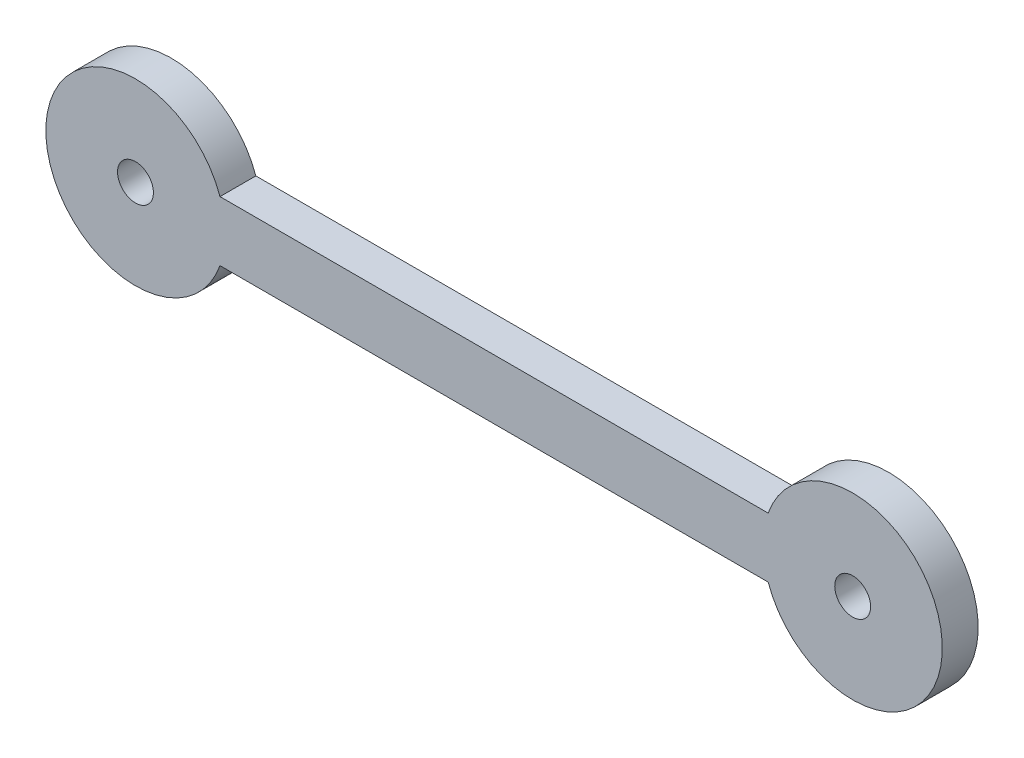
from build123d import *

# Parameters (mm, degrees)
ESQUISSE1_R      = 3
EXTRUSION2_DEPTH = 6


with BuildPart() as part:
    # Esquisse1 → Extrusion2 (new body)
    with BuildSketch(Plane.XY):
        with BuildLine():
            Line((14.142135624, 5), (105.857864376, 5))
            ThreePointArc((105.857864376, 5), (135, 0), (105.857864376, -5))
            Line((105.857864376, -5), (14.142135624, -5))
            ThreePointArc((14.142135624, -5), (-15, 0), (14.142135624, 5))
        make_face()
        Circle(ESQUISSE1_R, mode=Mode.SUBTRACT)
        with Locations(Location((120, 0, 0), (0, 0, 180))):
            Circle(ESQUISSE1_R, mode=Mode.SUBTRACT)
    extrude(amount=EXTRUSION2_DEPTH)


solid = part.part
